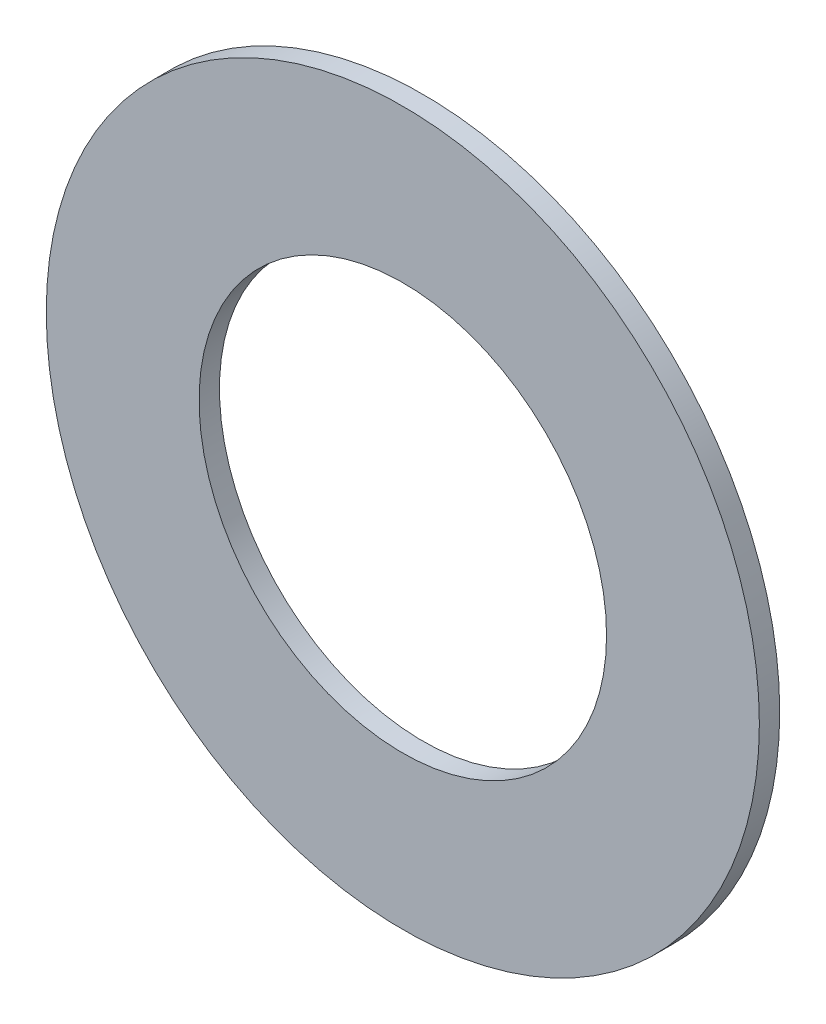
from build123d import *

# Parameters (mm, degrees)
ESQUISSE1_R          = 17.5
ESQUISSE1_R_2        = 10
BASE_EXTRUSION_DEPTH = 1


with BuildPart() as part:
    # Esquisse1 → Base-Extrusion (new body)
    with BuildSketch(Plane.XY):
        Circle(ESQUISSE1_R)
        Circle(ESQUISSE1_R_2, mode=Mode.SUBTRACT)
    extrude(amount=-BASE_EXTRUSION_DEPTH)


solid = part.part
